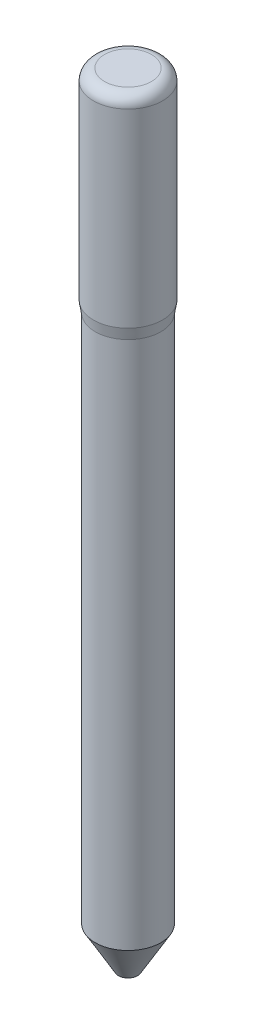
ISO-10303-21;
HEADER;
FILE_DESCRIPTION(('STEP AP214'),'2;1');
FILE_NAME('part.step','',(''),(''),'','','');
FILE_SCHEMA(('AUTOMOTIVE_DESIGN { 1 0 10303 214 1 1 1 1 }'));
ENDSEC;
DATA;
#1=APPLICATION_CONTEXT('core data for automotive mechanical design processes');
#2=APPLICATION_PROTOCOL_DEFINITION('international standard','automotive_design',2000,#1);
#3=PRODUCT_CONTEXT('',#1,'mechanical');
#4=PRODUCT('Part','Part','',(#3));
#5=PRODUCT_RELATED_PRODUCT_CATEGORY('part','',(#4));
#6=PRODUCT_DEFINITION_FORMATION('','',#4);
#7=PRODUCT_DEFINITION_CONTEXT('part definition',#1,'design');
#8=PRODUCT_DEFINITION('design','',#6,#7);
#9=PRODUCT_DEFINITION_SHAPE('','',#8);
#10=(LENGTH_UNIT() NAMED_UNIT(*) SI_UNIT(.MILLI.,.METRE.));
#11=(NAMED_UNIT(*) PLANE_ANGLE_UNIT() SI_UNIT($,.RADIAN.));
#12=(NAMED_UNIT(*) SI_UNIT($,.STERADIAN.) SOLID_ANGLE_UNIT());
#13=UNCERTAINTY_MEASURE_WITH_UNIT(LENGTH_MEASURE(1.E-05),#10,'distance_accuracy_value','');
#14=(GEOMETRIC_REPRESENTATION_CONTEXT(3) GLOBAL_UNCERTAINTY_ASSIGNED_CONTEXT((#13)) GLOBAL_UNIT_ASSIGNED_CONTEXT((#10,
#11,#12)) REPRESENTATION_CONTEXT('',''));
#15=CARTESIAN_POINT('',(0.,0.,0.));
#16=DIRECTION('',(0.,0.,1.));
#17=DIRECTION('',(1.,0.,0.));
#18=AXIS2_PLACEMENT_3D('',#15,#16,#17);
#19=CARTESIAN_POINT('',(0.,0.,0.));
#20=DIRECTION('',(0.,-1.,0.));
#21=DIRECTION('',(0.,0.,-1.));
#22=AXIS2_PLACEMENT_3D('',#19,#20,#21);
#23=PLANE('',#22);
#24=CARTESIAN_POINT('',(0.,0.,0.));
#25=DIRECTION('',(0.,-1.,0.));
#26=DIRECTION('',(0.,0.,-1.));
#27=AXIS2_PLACEMENT_3D('',#24,#25,#26);
#28=CIRCLE('',#27,0.215384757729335);
#29=CARTESIAN_POINT('',(0.,0.,0.215384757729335));
#30=VERTEX_POINT('',#29);
#31=EDGE_CURVE('E10',#30,#30,#28,.T.);
#32=ORIENTED_EDGE('',*,*,#31,.T.);
#33=EDGE_LOOP('',(#32));
#34=FACE_BOUND('',#33,.T.);
#35=ADVANCED_FACE('F35',(#34),#23,.T.);
#36=CARTESIAN_POINT('',(0.,0.,0.));
#37=DIRECTION('',(0.,1.,0.));
#38=DIRECTION('',(0.,0.,1.));
#39=AXIS2_PLACEMENT_3D('',#36,#37,#38);
#40=CONICAL_SURFACE('',#39,0.215384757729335,0.5235987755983);
#41=CARTESIAN_POINT('',(0.,0.9,0.));
#42=DIRECTION('',(0.,-1.,0.));
#43=DIRECTION('',(0.,0.,-1.));
#44=AXIS2_PLACEMENT_3D('',#41,#42,#43);
#45=CIRCLE('',#44,0.735);
#46=CARTESIAN_POINT('',(0.,0.9,0.735));
#47=VERTEX_POINT('',#46);
#48=EDGE_CURVE('E41',#47,#47,#45,.T.);
#49=CARTESIAN_POINT('',(0.,0.9,0.735));
#50=CARTESIAN_POINT('',(0.,0.890625,0.729587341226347));
#51=CARTESIAN_POINT('',(0.,0.88125,0.724174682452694));
#52=CARTESIAN_POINT('',(0.,0.8625,0.713349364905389));
#53=CARTESIAN_POINT('',(0.,0.853125,0.707936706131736));
#54=CARTESIAN_POINT('',(0.,0.834375,0.697111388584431));
#55=CARTESIAN_POINT('',(0.,0.825,0.691698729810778));
#56=CARTESIAN_POINT('',(0.,0.80625,0.680873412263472));
#57=CARTESIAN_POINT('',(0.,0.796875,0.67546075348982));
#58=CARTESIAN_POINT('',(0.,0.778125,0.664635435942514));
#59=CARTESIAN_POINT('',(0.,0.76875,0.659222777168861));
#60=CARTESIAN_POINT('',(0.,0.75,0.648397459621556));
#61=CARTESIAN_POINT('',(0.,0.740625,0.642984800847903));
#62=CARTESIAN_POINT('',(0.,0.721875,0.632159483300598));
#63=CARTESIAN_POINT('',(0.,0.7125,0.626746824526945));
#64=CARTESIAN_POINT('',(0.,0.69375,0.615921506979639));
#65=CARTESIAN_POINT('',(0.,0.684375,0.610508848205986));
#66=CARTESIAN_POINT('',(0.,0.665625,0.599683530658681));
#67=CARTESIAN_POINT('',(0.,0.65625,0.594270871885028));
#68=CARTESIAN_POINT('',(0.,0.6375,0.583445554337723));
#69=CARTESIAN_POINT('',(0.,0.628125,0.57803289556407));
#70=CARTESIAN_POINT('',(0.,0.609375,0.567207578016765));
#71=CARTESIAN_POINT('',(0.,0.6,0.561794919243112));
#72=CARTESIAN_POINT('',(0.,0.58125,0.550969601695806));
#73=CARTESIAN_POINT('',(0.,0.571875,0.545556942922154));
#74=CARTESIAN_POINT('',(0.,0.553125,0.534731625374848));
#75=CARTESIAN_POINT('',(0.,0.54375,0.529318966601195));
#76=CARTESIAN_POINT('',(0.,0.525,0.51849364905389));
#77=CARTESIAN_POINT('',(0.,0.515625,0.513080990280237));
#78=CARTESIAN_POINT('',(0.,0.496875,0.502255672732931));
#79=CARTESIAN_POINT('',(0.,0.4875,0.496843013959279));
#80=CARTESIAN_POINT('',(0.,0.46875,0.486017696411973));
#81=CARTESIAN_POINT('',(0.,0.459375,0.48060503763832));
#82=CARTESIAN_POINT('',(0.,0.440625,0.469779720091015));
#83=CARTESIAN_POINT('',(0.,0.43125,0.464367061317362));
#84=CARTESIAN_POINT('',(0.,0.4125,0.453541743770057));
#85=CARTESIAN_POINT('',(0.,0.403125,0.448129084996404));
#86=CARTESIAN_POINT('',(0.,0.384375,0.437303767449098));
#87=CARTESIAN_POINT('',(0.,0.375,0.431891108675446));
#88=CARTESIAN_POINT('',(0.,0.35625,0.42106579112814));
#89=CARTESIAN_POINT('',(0.,0.346875,0.415653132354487));
#90=CARTESIAN_POINT('',(0.,0.328125,0.404827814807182));
#91=CARTESIAN_POINT('',(0.,0.31875,0.399415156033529));
#92=CARTESIAN_POINT('',(0.,0.3,0.388589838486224));
#93=CARTESIAN_POINT('',(0.,0.290625,0.383177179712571));
#94=CARTESIAN_POINT('',(0.,0.271875,0.372351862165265));
#95=CARTESIAN_POINT('',(0.,0.2625,0.366939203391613));
#96=CARTESIAN_POINT('',(0.,0.24375,0.356113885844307));
#97=CARTESIAN_POINT('',(0.,0.234375,0.350701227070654));
#98=CARTESIAN_POINT('',(0.,0.215625,0.339875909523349));
#99=CARTESIAN_POINT('',(0.,0.20625,0.334463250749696));
#100=CARTESIAN_POINT('',(0.,0.1875,0.323637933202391));
#101=CARTESIAN_POINT('',(0.,0.178125,0.318225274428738));
#102=CARTESIAN_POINT('',(0.,0.159375,0.307399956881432));
#103=CARTESIAN_POINT('',(0.,0.15,0.301987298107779));
#104=CARTESIAN_POINT('',(0.,0.13125,0.291161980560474));
#105=CARTESIAN_POINT('',(0.,0.121875,0.285749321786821));
#106=CARTESIAN_POINT('',(0.,0.103125,0.274924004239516));
#107=CARTESIAN_POINT('',(0.,0.09375,0.269511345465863));
#108=CARTESIAN_POINT('',(0.,0.075,0.258686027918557));
#109=CARTESIAN_POINT('',(0.,0.065625,0.253273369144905));
#110=CARTESIAN_POINT('',(0.,0.046875,0.242448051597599));
#111=CARTESIAN_POINT('',(0.,0.0375,0.237035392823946));
#112=CARTESIAN_POINT('',(0.,0.01875,0.226210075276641));
#113=CARTESIAN_POINT('',(0.,0.00937500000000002,0.220797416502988));
#114=CARTESIAN_POINT('',(0.,0.,0.215384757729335));
#115=B_SPLINE_CURVE_WITH_KNOTS('',3,(#49,#50,#51,#52,#53,#54,#55,#56,#57,#58,#59,#60,#61,#62,
#63,#64,#65,#66,#67,#68,#69,#70,#71,#72,#73,#74,#75,#76,#77,#78,#79,#80,#81,#82,#83,#84,#85,#86,
#87,#88,#89,#90,#91,#92,#93,#94,#95,#96,#97,#98,#99,#100,#101,#102,#103,#104,#105,#106,#107,
#108,#109,#110,#111,#112,#113,#114),.UNSPECIFIED.,.F.,.F.,(4,2,2,2,2,2,2,2,2,2,2,2,2,2,2,2,2,2,
2,2,2,2,2,2,2,2,2,2,2,2,2,2,4),(0.,0.0324759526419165,0.0649519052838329,0.0974278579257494,
0.129903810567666,0.162379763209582,0.194855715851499,0.227331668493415,0.259807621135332,
0.292283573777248,0.324759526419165,0.357235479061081,0.389711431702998,0.422187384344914,
0.454663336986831,0.487139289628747,0.519615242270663,0.55209119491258,0.584567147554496,
0.617043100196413,0.649519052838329,0.681995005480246,0.714470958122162,0.746946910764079,
0.779422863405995,0.811898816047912,0.844374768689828,0.876850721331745,0.909326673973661,
0.941802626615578,0.974278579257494,1.00675453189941,1.03923048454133),.UNSPECIFIED.);
#116=EDGE_CURVE('BSEAM73',#47,#30,#115,.T.);
#117=ORIENTED_EDGE('',*,*,#48,.T.);
#118=ORIENTED_EDGE('',*,*,#31,.F.);
#119=ORIENTED_EDGE('',*,*,#116,.T.);
#120=ORIENTED_EDGE('',*,*,#116,.F.);
#121=EDGE_LOOP('',(#117,#119,#118,#120));
#122=FACE_BOUND('',#121,.T.);
#123=ADVANCED_FACE('F73',(#122),#40,.T.);
#124=CARTESIAN_POINT('',(0.,0.,0.));
#125=DIRECTION('',(0.,-1.,0.));
#126=DIRECTION('',(0.,0.,-1.));
#127=AXIS2_PLACEMENT_3D('',#124,#125,#126);
#128=CYLINDRICAL_SURFACE('',#127,0.735);
#129=CARTESIAN_POINT('',(0.,12.75,0.));
#130=DIRECTION('',(0.,-1.,0.));
#131=DIRECTION('',(0.,0.,-1.));
#132=AXIS2_PLACEMENT_3D('',#129,#130,#131);
#133=CIRCLE('',#132,0.735);
#134=CARTESIAN_POINT('',(0.,12.75,-0.735));
#135=VERTEX_POINT('',#134);
#136=EDGE_CURVE('E45',#135,#135,#133,.T.);
#137=ORIENTED_EDGE('',*,*,#136,.T.);
#138=EDGE_LOOP('',(#137));
#139=FACE_BOUND('',#138,.T.);
#140=ORIENTED_EDGE('',*,*,#48,.F.);
#141=EDGE_LOOP('',(#140));
#142=FACE_BOUND('',#141,.T.);
#143=ADVANCED_FACE('F77',(#139,#142),#128,.T.);
#144=CARTESIAN_POINT('',(0.,12.75,0.));
#145=DIRECTION('',(0.,1.,0.));
#146=DIRECTION('',(0.,0.,1.));
#147=AXIS2_PLACEMENT_3D('',#144,#145,#146);
#148=CONICAL_SURFACE('',#147,0.735,0.158655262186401);
#149=CARTESIAN_POINT('',(0.,13.,0.));
#150=DIRECTION('',(0.,-1.,0.));
#151=DIRECTION('',(0.,0.,-1.));
#152=AXIS2_PLACEMENT_3D('',#149,#150,#151);
#153=CIRCLE('',#152,0.775);
#154=CARTESIAN_POINT('',(0.,13.,-0.775));
#155=VERTEX_POINT('',#154);
#156=EDGE_CURVE('E49',#155,#155,#153,.T.);
#157=ORIENTED_EDGE('',*,*,#156,.T.);
#158=EDGE_LOOP('',(#157));
#159=FACE_BOUND('',#158,.T.);
#160=ORIENTED_EDGE('',*,*,#136,.F.);
#161=EDGE_LOOP('',(#160));
#162=FACE_BOUND('',#161,.T.);
#163=ADVANCED_FACE('F81',(#159,#162),#148,.T.);
#164=CARTESIAN_POINT('',(0.,0.,0.));
#165=DIRECTION('',(0.,-1.,0.));
#166=DIRECTION('',(0.,0.,-1.));
#167=AXIS2_PLACEMENT_3D('',#164,#165,#166);
#168=CYLINDRICAL_SURFACE('',#167,0.775);
#169=CARTESIAN_POINT('',(0.,17.25,0.));
#170=DIRECTION('',(0.,-1.,0.));
#171=DIRECTION('',(0.,0.,-1.));
#172=AXIS2_PLACEMENT_3D('',#169,#170,#171);
#173=CIRCLE('',#172,0.775);
#174=CARTESIAN_POINT('',(0.,17.25,-0.775));
#175=VERTEX_POINT('',#174);
#176=EDGE_CURVE('E54',#175,#175,#173,.T.);
#177=ORIENTED_EDGE('',*,*,#176,.T.);
#178=EDGE_LOOP('',(#177));
#179=FACE_BOUND('',#178,.T.);
#180=ORIENTED_EDGE('',*,*,#156,.F.);
#181=EDGE_LOOP('',(#180));
#182=FACE_BOUND('',#181,.T.);
#183=ADVANCED_FACE('F70',(#179,#182),#168,.T.);
#184=CARTESIAN_POINT('',(0.,17.25,0.));
#185=DIRECTION('',(0.,-1.,0.));
#186=DIRECTION('',(0.,0.,-1.));
#187=AXIS2_PLACEMENT_3D('',#184,#185,#186);
#188=TOROIDAL_SURFACE('',#187,0.525,0.25);
#189=CARTESIAN_POINT('',(0.,17.5,0.));
#190=DIRECTION('',(0.,-1.,0.));
#191=DIRECTION('',(0.,0.,-1.));
#192=AXIS2_PLACEMENT_3D('',#189,#190,#191);
#193=CIRCLE('',#192,0.525);
#194=CARTESIAN_POINT('',(0.,17.5,-0.525));
#195=VERTEX_POINT('',#194);
#196=EDGE_CURVE('E57',#195,#195,#193,.T.);
#197=ORIENTED_EDGE('',*,*,#196,.T.);
#198=EDGE_LOOP('',(#197));
#199=FACE_BOUND('',#198,.T.);
#200=ORIENTED_EDGE('',*,*,#176,.F.);
#201=EDGE_LOOP('',(#200));
#202=FACE_BOUND('',#201,.T.);
#203=ADVANCED_FACE('F61',(#199,#202),#188,.T.);
#204=CARTESIAN_POINT('',(0.525,17.5,0.));
#205=DIRECTION('',(0.,1.,0.));
#206=DIRECTION('',(0.,0.,1.));
#207=AXIS2_PLACEMENT_3D('',#204,#205,#206);
#208=PLANE('',#207);
#209=ORIENTED_EDGE('',*,*,#196,.F.);
#210=EDGE_LOOP('',(#209));
#211=FACE_BOUND('',#210,.T.);
#212=ADVANCED_FACE('F64',(#211),#208,.T.);
#213=CLOSED_SHELL('',(#35,#123,#143,#163,#183,#203,#212));
#214=MANIFOLD_SOLID_BREP('B2',#213);
#215=ADVANCED_BREP_SHAPE_REPRESENTATION('',(#18,#214),#14);
#216=SHAPE_DEFINITION_REPRESENTATION(#9,#215);
ENDSEC;
END-ISO-10303-21;
